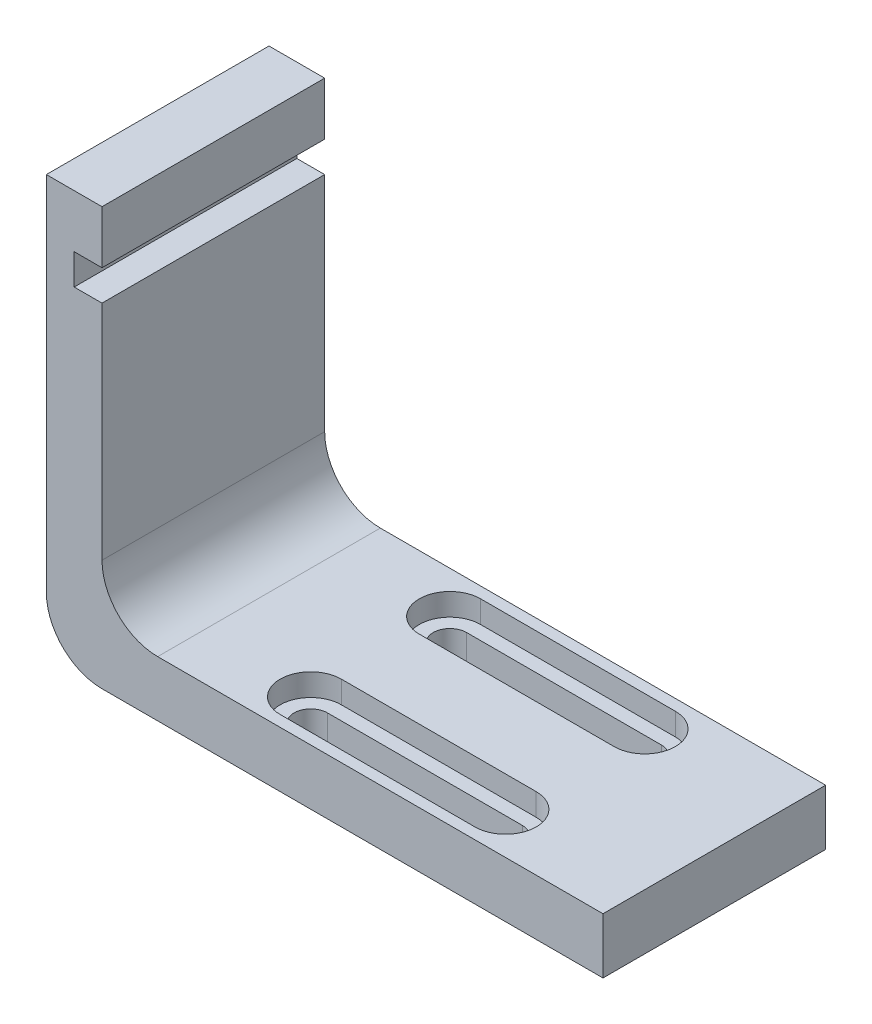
ISO-10303-21;
HEADER;
FILE_DESCRIPTION(('STEP AP214'),'2;1');
FILE_NAME('part.step','',(''),(''),'','','');
FILE_SCHEMA(('AUTOMOTIVE_DESIGN { 1 0 10303 214 1 1 1 1 }'));
ENDSEC;
DATA;
#1=APPLICATION_CONTEXT('core data for automotive mechanical design processes');
#2=APPLICATION_PROTOCOL_DEFINITION('international standard','automotive_design',2000,#1);
#3=PRODUCT_CONTEXT('',#1,'mechanical');
#4=PRODUCT('Part','Part','',(#3));
#5=PRODUCT_RELATED_PRODUCT_CATEGORY('part','',(#4));
#6=PRODUCT_DEFINITION_FORMATION('','',#4);
#7=PRODUCT_DEFINITION_CONTEXT('part definition',#1,'design');
#8=PRODUCT_DEFINITION('design','',#6,#7);
#9=PRODUCT_DEFINITION_SHAPE('','',#8);
#10=(LENGTH_UNIT() NAMED_UNIT(*) SI_UNIT(.MILLI.,.METRE.));
#11=(NAMED_UNIT(*) PLANE_ANGLE_UNIT() SI_UNIT($,.RADIAN.));
#12=(NAMED_UNIT(*) SI_UNIT($,.STERADIAN.) SOLID_ANGLE_UNIT());
#13=UNCERTAINTY_MEASURE_WITH_UNIT(LENGTH_MEASURE(1.E-05),#10,'distance_accuracy_value','');
#14=(GEOMETRIC_REPRESENTATION_CONTEXT(3) GLOBAL_UNCERTAINTY_ASSIGNED_CONTEXT((#13)) GLOBAL_UNIT_ASSIGNED_CONTEXT((#10,
#11,#12)) REPRESENTATION_CONTEXT('',''));
#15=CARTESIAN_POINT('',(0.,0.,0.));
#16=DIRECTION('',(0.,0.,1.));
#17=DIRECTION('',(1.,0.,0.));
#18=AXIS2_PLACEMENT_3D('',#15,#16,#17);
#19=CARTESIAN_POINT('',(40.,6.,-12.5));
#20=DIRECTION('',(0.,-1.,0.));
#21=DIRECTION('',(0.,0.,-1.));
#22=AXIS2_PLACEMENT_3D('',#19,#20,#21);
#23=PLANE('',#22);
#24=CARTESIAN_POINT('',(40.,6.,-12.5));
#25=DIRECTION('',(0.,-1.,0.));
#26=DIRECTION('',(0.,0.,-1.));
#27=AXIS2_PLACEMENT_3D('',#24,#25,#26);
#28=CIRCLE('',#27,5.5);
#29=CARTESIAN_POINT('',(40.,6.,-7.));
#30=VERTEX_POINT('',#29);
#31=CARTESIAN_POINT('',(40.,6.,-18.));
#32=VERTEX_POINT('',#31);
#33=EDGE_CURVE('E323',#30,#32,#28,.T.);
#34=ORIENTED_EDGE('',*,*,#33,.F.);
#35=DIRECTION('',(1.,0.,0.));
#36=VECTOR('',#35,1.);
#37=CARTESIAN_POINT('',(40.,6.,-7.));
#38=LINE('',#37,#36);
#39=CARTESIAN_POINT('',(75.,6.,-7.));
#40=VERTEX_POINT('',#39);
#41=EDGE_CURVE('E334',#30,#40,#38,.T.);
#42=ORIENTED_EDGE('',*,*,#41,.T.);
#43=CARTESIAN_POINT('',(75.,6.,-12.5));
#44=DIRECTION('',(0.,-1.,0.));
#45=DIRECTION('',(0.,0.,-1.));
#46=AXIS2_PLACEMENT_3D('',#43,#44,#45);
#47=CIRCLE('',#46,5.5);
#48=CARTESIAN_POINT('',(75.,6.,-18.));
#49=VERTEX_POINT('',#48);
#50=EDGE_CURVE('E331',#49,#40,#47,.T.);
#51=ORIENTED_EDGE('',*,*,#50,.F.);
#52=DIRECTION('',(1.,0.,0.));
#53=VECTOR('',#52,1.);
#54=CARTESIAN_POINT('',(40.,6.,-18.));
#55=LINE('',#54,#53);
#56=EDGE_CURVE('E327',#32,#49,#55,.T.);
#57=ORIENTED_EDGE('',*,*,#56,.F.);
#58=EDGE_LOOP('',(#34,#42,#51,#57));
#59=FACE_BOUND('',#58,.T.);
#60=CARTESIAN_POINT('',(75.,6.,-12.5));
#61=DIRECTION('',(0.,1.,0.));
#62=DIRECTION('',(0.,0.,-1.));
#63=AXIS2_PLACEMENT_3D('',#60,#61,#62);
#64=CIRCLE('',#63,3.);
#65=CARTESIAN_POINT('',(75.,6.,-9.5));
#66=VERTEX_POINT('',#65);
#67=CARTESIAN_POINT('',(75.,6.,-15.5));
#68=VERTEX_POINT('',#67);
#69=EDGE_CURVE('E232',#66,#68,#64,.T.);
#70=ORIENTED_EDGE('',*,*,#69,.F.);
#71=DIRECTION('',(1.,0.,0.));
#72=VECTOR('',#71,1.);
#73=CARTESIAN_POINT('',(75.,6.,-9.5));
#74=LINE('',#73,#72);
#75=CARTESIAN_POINT('',(40.,6.,-9.5));
#76=VERTEX_POINT('',#75);
#77=EDGE_CURVE('E253',#76,#66,#74,.T.);
#78=ORIENTED_EDGE('',*,*,#77,.F.);
#79=CARTESIAN_POINT('',(40.,6.,-12.5));
#80=DIRECTION('',(0.,1.,0.));
#81=DIRECTION('',(0.,0.,-1.));
#82=AXIS2_PLACEMENT_3D('',#79,#80,#81);
#83=CIRCLE('',#82,3.);
#84=CARTESIAN_POINT('',(40.,6.,-15.5));
#85=VERTEX_POINT('',#84);
#86=EDGE_CURVE('E64',#85,#76,#83,.T.);
#87=ORIENTED_EDGE('',*,*,#86,.F.);
#88=DIRECTION('',(-1.,0.,0.));
#89=VECTOR('',#88,1.);
#90=CARTESIAN_POINT('',(40.,6.,-15.5));
#91=LINE('',#90,#89);
#92=EDGE_CURVE('E267',#68,#85,#91,.T.);
#93=ORIENTED_EDGE('',*,*,#92,.F.);
#94=EDGE_LOOP('',(#70,#78,#87,#93));
#95=FACE_BOUND('',#94,.T.);
#96=ADVANCED_FACE('F39',(#59,#95),#23,.F.);
#97=CARTESIAN_POINT('',(9.99999999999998,10.,-20.));
#98=DIRECTION('',(0.,1.,0.));
#99=DIRECTION('',(0.,0.,1.));
#100=AXIS2_PLACEMENT_3D('',#97,#98,#99);
#101=PLANE('',#100);
#102=CARTESIAN_POINT('',(40.,10.,12.5));
#103=DIRECTION('',(0.,1.,0.));
#104=DIRECTION('',(0.,0.,1.));
#105=AXIS2_PLACEMENT_3D('',#102,#103,#104);
#106=CIRCLE('',#105,5.5);
#107=CARTESIAN_POINT('',(40.,10.,7.));
#108=VERTEX_POINT('',#107);
#109=CARTESIAN_POINT('',(40.,10.,18.));
#110=VERTEX_POINT('',#109);
#111=EDGE_CURVE('E344',#108,#110,#106,.T.);
#112=ORIENTED_EDGE('',*,*,#111,.F.);
#113=DIRECTION('',(1.,0.,0.));
#114=VECTOR('',#113,1.);
#115=CARTESIAN_POINT('',(40.,10.,7.));
#116=LINE('',#115,#114);
#117=CARTESIAN_POINT('',(75.,10.,7.));
#118=VERTEX_POINT('',#117);
#119=EDGE_CURVE('E382',#108,#118,#116,.T.);
#120=ORIENTED_EDGE('',*,*,#119,.T.);
#121=CARTESIAN_POINT('',(75.,10.,12.5));
#122=DIRECTION('',(0.,1.,0.));
#123=DIRECTION('',(0.,0.,1.));
#124=AXIS2_PLACEMENT_3D('',#121,#122,#123);
#125=CIRCLE('',#124,5.5);
#126=CARTESIAN_POINT('',(75.,10.,18.));
#127=VERTEX_POINT('',#126);
#128=EDGE_CURVE('E386',#127,#118,#125,.T.);
#129=ORIENTED_EDGE('',*,*,#128,.F.);
#130=DIRECTION('',(1.,0.,0.));
#131=VECTOR('',#130,1.);
#132=CARTESIAN_POINT('',(40.,10.,18.));
#133=LINE('',#132,#131);
#134=EDGE_CURVE('E391',#110,#127,#133,.T.);
#135=ORIENTED_EDGE('',*,*,#134,.F.);
#136=EDGE_LOOP('',(#112,#120,#129,#135));
#137=FACE_BOUND('',#136,.T.);
#138=DIRECTION('',(-1.,0.,0.));
#139=VECTOR('',#138,1.);
#140=CARTESIAN_POINT('',(9.99999999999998,10.,-20.));
#141=LINE('',#140,#139);
#142=CARTESIAN_POINT('',(100.,10.,-20.));
#143=VERTEX_POINT('',#142);
#144=CARTESIAN_POINT('',(20.,10.,-20.));
#145=VERTEX_POINT('',#144);
#146=EDGE_CURVE('E477',#143,#145,#141,.T.);
#147=ORIENTED_EDGE('',*,*,#146,.T.);
#148=DIRECTION('',(0.,0.,1.));
#149=VECTOR('',#148,1.);
#150=CARTESIAN_POINT('',(20.,10.,20.));
#151=LINE('',#150,#149);
#152=CARTESIAN_POINT('',(20.,10.,20.));
#153=VERTEX_POINT('',#152);
#154=EDGE_CURVE('E516',#145,#153,#151,.T.);
#155=ORIENTED_EDGE('',*,*,#154,.T.);
#156=DIRECTION('',(-1.,0.,0.));
#157=VECTOR('',#156,1.);
#158=CARTESIAN_POINT('',(9.99999999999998,10.,20.));
#159=LINE('',#158,#157);
#160=CARTESIAN_POINT('',(100.,10.,20.));
#161=VERTEX_POINT('',#160);
#162=EDGE_CURVE('E454',#161,#153,#159,.T.);
#163=ORIENTED_EDGE('',*,*,#162,.F.);
#164=DIRECTION('',(0.,0.,1.));
#165=VECTOR('',#164,1.);
#166=CARTESIAN_POINT('',(100.,10.,-20.));
#167=LINE('',#166,#165);
#168=EDGE_CURVE('E498',#143,#161,#167,.T.);
#169=ORIENTED_EDGE('',*,*,#168,.F.);
#170=EDGE_LOOP('',(#147,#155,#163,#169));
#171=FACE_BOUND('',#170,.T.);
#172=DIRECTION('',(1.,0.,0.));
#173=VECTOR('',#172,1.);
#174=CARTESIAN_POINT('',(40.,10.,-7.));
#175=LINE('',#174,#173);
#176=CARTESIAN_POINT('',(40.,10.,-7.));
#177=VERTEX_POINT('',#176);
#178=CARTESIAN_POINT('',(75.,10.,-7.));
#179=VERTEX_POINT('',#178);
#180=EDGE_CURVE('E328',#177,#179,#175,.T.);
#181=ORIENTED_EDGE('',*,*,#180,.F.);
#182=CARTESIAN_POINT('',(40.,10.,-12.5));
#183=DIRECTION('',(0.,-1.,0.));
#184=DIRECTION('',(0.,0.,-1.));
#185=AXIS2_PLACEMENT_3D('',#182,#183,#184);
#186=CIRCLE('',#185,5.5);
#187=CARTESIAN_POINT('',(40.,10.,-18.));
#188=VERTEX_POINT('',#187);
#189=EDGE_CURVE('E339',#177,#188,#186,.T.);
#190=ORIENTED_EDGE('',*,*,#189,.T.);
#191=DIRECTION('',(1.,0.,0.));
#192=VECTOR('',#191,1.);
#193=CARTESIAN_POINT('',(40.,10.,-18.));
#194=LINE('',#193,#192);
#195=CARTESIAN_POINT('',(75.,10.,-18.));
#196=VERTEX_POINT('',#195);
#197=EDGE_CURVE('E343',#188,#196,#194,.T.);
#198=ORIENTED_EDGE('',*,*,#197,.T.);
#199=CARTESIAN_POINT('',(75.,10.,-12.5));
#200=DIRECTION('',(0.,-1.,0.));
#201=DIRECTION('',(0.,0.,-1.));
#202=AXIS2_PLACEMENT_3D('',#199,#200,#201);
#203=CIRCLE('',#202,5.5);
#204=EDGE_CURVE('E348',#196,#179,#203,.T.);
#205=ORIENTED_EDGE('',*,*,#204,.T.);
#206=EDGE_LOOP('',(#181,#190,#198,#205));
#207=FACE_BOUND('',#206,.T.);
#208=ADVANCED_FACE('F544',(#137,#171,#207),#101,.T.);
#209=CARTESIAN_POINT('',(10.,75.,-20.));
#210=DIRECTION('',(1.,0.,0.));
#211=DIRECTION('',(0.,1.,0.));
#212=AXIS2_PLACEMENT_3D('',#209,#210,#211);
#213=PLANE('',#212);
#214=DIRECTION('',(0.,1.,0.));
#215=VECTOR('',#214,1.);
#216=CARTESIAN_POINT('',(10.,75.,20.));
#217=LINE('',#216,#215);
#218=CARTESIAN_POINT('',(9.99999999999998,20.,20.));
#219=VERTEX_POINT('',#218);
#220=CARTESIAN_POINT('',(9.99999999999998,60.,20.));
#221=VERTEX_POINT('',#220);
#222=EDGE_CURVE('E459',#219,#221,#217,.T.);
#223=ORIENTED_EDGE('',*,*,#222,.F.);
#224=DIRECTION('',(0.,0.,1.));
#225=VECTOR('',#224,1.);
#226=CARTESIAN_POINT('',(9.99999999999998,20.,-20.));
#227=LINE('',#226,#225);
#228=CARTESIAN_POINT('',(9.99999999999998,20.,-20.));
#229=VERTEX_POINT('',#228);
#230=EDGE_CURVE('E520',#219,#229,#227,.F.);
#231=ORIENTED_EDGE('',*,*,#230,.T.);
#232=DIRECTION('',(0.,1.,0.));
#233=VECTOR('',#232,1.);
#234=CARTESIAN_POINT('',(10.,75.,-20.));
#235=LINE('',#234,#233);
#236=CARTESIAN_POINT('',(9.99999999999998,60.,-20.));
#237=VERTEX_POINT('',#236);
#238=EDGE_CURVE('E482',#229,#237,#235,.T.);
#239=ORIENTED_EDGE('',*,*,#238,.T.);
#240=DIRECTION('',(0.,0.,1.));
#241=VECTOR('',#240,1.);
#242=CARTESIAN_POINT('',(9.99999999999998,60.,-80.));
#243=LINE('',#242,#241);
#244=EDGE_CURVE('E422',#237,#221,#243,.T.);
#245=ORIENTED_EDGE('',*,*,#244,.T.);
#246=EDGE_LOOP('',(#223,#231,#239,#245));
#247=FACE_BOUND('',#246,.T.);
#248=ADVANCED_FACE('F533',(#247),#213,.T.);
#249=CARTESIAN_POINT('',(0.,0.,-20.));
#250=DIRECTION('',(-1.,0.,0.));
#251=DIRECTION('',(0.,0.,1.));
#252=AXIS2_PLACEMENT_3D('',#249,#250,#251);
#253=PLANE('',#252);
#254=CARTESIAN_POINT('',(0.,63.,0.));
#255=DIRECTION('',(-1.,0.,0.));
#256=DIRECTION('',(0.,0.,1.));
#257=AXIS2_PLACEMENT_3D('',#254,#255,#256);
#258=CIRCLE('',#257,1.5);
#259=CARTESIAN_POINT('',(0.,63.,1.5));
#260=VERTEX_POINT('',#259);
#261=EDGE_CURVE('E259',#260,#260,#258,.T.);
#262=ORIENTED_EDGE('',*,*,#261,.F.);
#263=EDGE_LOOP('',(#262));
#264=FACE_BOUND('',#263,.T.);
#265=DIRECTION('',(0.,-1.,0.));
#266=VECTOR('',#265,1.);
#267=CARTESIAN_POINT('',(0.,0.,-20.));
#268=LINE('',#267,#266);
#269=CARTESIAN_POINT('',(0.,75.,-20.));
#270=VERTEX_POINT('',#269);
#271=CARTESIAN_POINT('',(0.,10.,-20.));
#272=VERTEX_POINT('',#271);
#273=EDGE_CURVE('E466',#270,#272,#268,.T.);
#274=ORIENTED_EDGE('',*,*,#273,.T.);
#275=DIRECTION('',(0.,0.,1.));
#276=VECTOR('',#275,1.);
#277=CARTESIAN_POINT('',(0.,10.,-20.));
#278=LINE('',#277,#276);
#279=CARTESIAN_POINT('',(0.,10.,20.));
#280=VERTEX_POINT('',#279);
#281=EDGE_CURVE('E493',#272,#280,#278,.T.);
#282=ORIENTED_EDGE('',*,*,#281,.T.);
#283=DIRECTION('',(0.,-1.,0.));
#284=VECTOR('',#283,1.);
#285=CARTESIAN_POINT('',(0.,0.,20.));
#286=LINE('',#285,#284);
#287=CARTESIAN_POINT('',(0.,75.,20.));
#288=VERTEX_POINT('',#287);
#289=EDGE_CURVE('E443',#288,#280,#286,.T.);
#290=ORIENTED_EDGE('',*,*,#289,.F.);
#291=DIRECTION('',(0.,0.,1.));
#292=VECTOR('',#291,1.);
#293=CARTESIAN_POINT('',(0.,75.,-20.));
#294=LINE('',#293,#292);
#295=EDGE_CURVE('E490',#270,#288,#294,.T.);
#296=ORIENTED_EDGE('',*,*,#295,.F.);
#297=EDGE_LOOP('',(#274,#282,#290,#296));
#298=FACE_BOUND('',#297,.T.);
#299=ADVANCED_FACE('F560',(#264,#298),#253,.T.);
#300=CARTESIAN_POINT('',(0.,75.,-20.));
#301=DIRECTION('',(0.,1.,0.));
#302=DIRECTION('',(0.,0.,1.));
#303=AXIS2_PLACEMENT_3D('',#300,#301,#302);
#304=PLANE('',#303);
#305=ORIENTED_EDGE('',*,*,#295,.T.);
#306=DIRECTION('',(-1.,0.,0.));
#307=VECTOR('',#306,1.);
#308=CARTESIAN_POINT('',(0.,75.,20.));
#309=LINE('',#308,#307);
#310=CARTESIAN_POINT('',(10.,75.,20.));
#311=VERTEX_POINT('',#310);
#312=EDGE_CURVE('E462',#311,#288,#309,.T.);
#313=ORIENTED_EDGE('',*,*,#312,.F.);
#314=DIRECTION('',(0.,0.,1.));
#315=VECTOR('',#314,1.);
#316=CARTESIAN_POINT('',(10.,75.,-20.));
#317=LINE('',#316,#315);
#318=CARTESIAN_POINT('',(10.,75.,-20.));
#319=VERTEX_POINT('',#318);
#320=EDGE_CURVE('E494',#319,#311,#317,.T.);
#321=ORIENTED_EDGE('',*,*,#320,.F.);
#322=DIRECTION('',(-1.,0.,0.));
#323=VECTOR('',#322,1.);
#324=CARTESIAN_POINT('',(0.,75.,-20.));
#325=LINE('',#324,#323);
#326=EDGE_CURVE('E485',#319,#270,#325,.T.);
#327=ORIENTED_EDGE('',*,*,#326,.T.);
#328=EDGE_LOOP('',(#305,#313,#321,#327));
#329=FACE_BOUND('',#328,.T.);
#330=ADVANCED_FACE('F566',(#329),#304,.T.);
#331=DIRECTION('',(0.,0.,1.));
#332=VECTOR('',#331,1.);
#333=CARTESIAN_POINT('',(9.99999999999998,65.5,-80.));
#334=LINE('',#333,#332);
#335=CARTESIAN_POINT('',(9.99999999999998,65.5,-20.));
#336=VERTEX_POINT('',#335);
#337=CARTESIAN_POINT('',(10.,65.5,20.));
#338=VERTEX_POINT('',#337);
#339=EDGE_CURVE('E421',#336,#338,#334,.T.);
#340=ORIENTED_EDGE('',*,*,#339,.F.);
#341=EDGE_CURVE('E481',#336,#319,#235,.T.);
#342=ORIENTED_EDGE('',*,*,#341,.T.);
#343=ORIENTED_EDGE('',*,*,#320,.T.);
#344=EDGE_CURVE('E458',#338,#311,#217,.T.);
#345=ORIENTED_EDGE('',*,*,#344,.F.);
#346=EDGE_LOOP('',(#340,#342,#343,#345));
#347=FACE_BOUND('',#346,.T.);
#348=ADVANCED_FACE('F575',(#347),#213,.T.);
#349=CARTESIAN_POINT('',(100.,10.,-20.));
#350=DIRECTION('',(1.,0.,0.));
#351=DIRECTION('',(0.,0.,-1.));
#352=AXIS2_PLACEMENT_3D('',#349,#350,#351);
#353=PLANE('',#352);
#354=ORIENTED_EDGE('',*,*,#168,.T.);
#355=DIRECTION('',(0.,1.,0.));
#356=VECTOR('',#355,1.);
#357=CARTESIAN_POINT('',(100.,10.,20.));
#358=LINE('',#357,#356);
#359=CARTESIAN_POINT('',(100.,0.,20.));
#360=VERTEX_POINT('',#359);
#361=EDGE_CURVE('E450',#360,#161,#358,.T.);
#362=ORIENTED_EDGE('',*,*,#361,.F.);
#363=DIRECTION('',(0.,0.,1.));
#364=VECTOR('',#363,1.);
#365=CARTESIAN_POINT('',(100.,0.,-20.));
#366=LINE('',#365,#364);
#367=CARTESIAN_POINT('',(100.,0.,-20.));
#368=VERTEX_POINT('',#367);
#369=EDGE_CURVE('E489',#368,#360,#366,.T.);
#370=ORIENTED_EDGE('',*,*,#369,.F.);
#371=DIRECTION('',(0.,1.,0.));
#372=VECTOR('',#371,1.);
#373=CARTESIAN_POINT('',(100.,10.,-20.));
#374=LINE('',#373,#372);
#375=EDGE_CURVE('E473',#368,#143,#374,.T.);
#376=ORIENTED_EDGE('',*,*,#375,.T.);
#377=EDGE_LOOP('',(#354,#362,#370,#376));
#378=FACE_BOUND('',#377,.T.);
#379=ADVANCED_FACE('F548',(#378),#353,.T.);
#380=CARTESIAN_POINT('',(0.,0.,-20.));
#381=DIRECTION('',(0.,-1.,0.));
#382=DIRECTION('',(0.,0.,-1.));
#383=AXIS2_PLACEMENT_3D('',#380,#381,#382);
#384=PLANE('',#383);
#385=CARTESIAN_POINT('',(75.,0.,-12.5));
#386=DIRECTION('',(0.,1.,0.));
#387=DIRECTION('',(0.,0.,-1.));
#388=AXIS2_PLACEMENT_3D('',#385,#386,#387);
#389=CIRCLE('',#388,3.);
#390=CARTESIAN_POINT('',(75.,0.,-9.5));
#391=VERTEX_POINT('',#390);
#392=CARTESIAN_POINT('',(75.,0.,-15.5));
#393=VERTEX_POINT('',#392);
#394=EDGE_CURVE('E229',#391,#393,#389,.T.);
#395=ORIENTED_EDGE('',*,*,#394,.T.);
#396=DIRECTION('',(-1.,0.,0.));
#397=VECTOR('',#396,1.);
#398=CARTESIAN_POINT('',(40.,0.,-15.5));
#399=LINE('',#398,#397);
#400=CARTESIAN_POINT('',(40.,0.,-15.5));
#401=VERTEX_POINT('',#400);
#402=EDGE_CURVE('E242',#393,#401,#399,.T.);
#403=ORIENTED_EDGE('',*,*,#402,.T.);
#404=CARTESIAN_POINT('',(40.,0.,-12.5));
#405=DIRECTION('',(0.,1.,0.));
#406=DIRECTION('',(0.,0.,-1.));
#407=AXIS2_PLACEMENT_3D('',#404,#405,#406);
#408=CIRCLE('',#407,3.);
#409=CARTESIAN_POINT('',(40.,0.,-9.5));
#410=VERTEX_POINT('',#409);
#411=EDGE_CURVE('E247',#401,#410,#408,.T.);
#412=ORIENTED_EDGE('',*,*,#411,.T.);
#413=DIRECTION('',(1.,0.,0.));
#414=VECTOR('',#413,1.);
#415=CARTESIAN_POINT('',(75.,0.,-9.5));
#416=LINE('',#415,#414);
#417=EDGE_CURVE('E238',#410,#391,#416,.T.);
#418=ORIENTED_EDGE('',*,*,#417,.T.);
#419=EDGE_LOOP('',(#395,#403,#412,#418));
#420=FACE_BOUND('',#419,.T.);
#421=CARTESIAN_POINT('',(40.,0.,12.5));
#422=DIRECTION('',(0.,1.,0.));
#423=DIRECTION('',(0.,0.,1.));
#424=AXIS2_PLACEMENT_3D('',#421,#422,#423);
#425=CIRCLE('',#424,3.);
#426=CARTESIAN_POINT('',(40.,0.,9.5));
#427=VERTEX_POINT('',#426);
#428=CARTESIAN_POINT('',(40.,0.,15.5));
#429=VERTEX_POINT('',#428);
#430=EDGE_CURVE('E282',#427,#429,#425,.T.);
#431=ORIENTED_EDGE('',*,*,#430,.T.);
#432=DIRECTION('',(1.,0.,0.));
#433=VECTOR('',#432,1.);
#434=CARTESIAN_POINT('',(40.,0.,15.5));
#435=LINE('',#434,#433);
#436=CARTESIAN_POINT('',(75.,0.,15.5));
#437=VERTEX_POINT('',#436);
#438=EDGE_CURVE('E286',#429,#437,#435,.T.);
#439=ORIENTED_EDGE('',*,*,#438,.T.);
#440=CARTESIAN_POINT('',(75.,0.,12.5));
#441=DIRECTION('',(0.,1.,0.));
#442=DIRECTION('',(0.,0.,1.));
#443=AXIS2_PLACEMENT_3D('',#440,#441,#442);
#444=CIRCLE('',#443,3.);
#445=CARTESIAN_POINT('',(75.,0.,9.5));
#446=VERTEX_POINT('',#445);
#447=EDGE_CURVE('E291',#437,#446,#444,.T.);
#448=ORIENTED_EDGE('',*,*,#447,.T.);
#449=DIRECTION('',(-1.,0.,0.));
#450=VECTOR('',#449,1.);
#451=CARTESIAN_POINT('',(75.,0.,9.5));
#452=LINE('',#451,#450);
#453=EDGE_CURVE('E295',#446,#427,#452,.T.);
#454=ORIENTED_EDGE('',*,*,#453,.T.);
#455=EDGE_LOOP('',(#431,#439,#448,#454));
#456=FACE_BOUND('',#455,.T.);
#457=DIRECTION('',(1.,0.,0.));
#458=VECTOR('',#457,1.);
#459=CARTESIAN_POINT('',(0.,0.,20.));
#460=LINE('',#459,#458);
#461=CARTESIAN_POINT('',(10.,0.,20.));
#462=VERTEX_POINT('',#461);
#463=EDGE_CURVE('E447',#462,#360,#460,.T.);
#464=ORIENTED_EDGE('',*,*,#463,.F.);
#465=DIRECTION('',(0.,0.,1.));
#466=VECTOR('',#465,1.);
#467=CARTESIAN_POINT('',(10.,0.,-20.));
#468=LINE('',#467,#466);
#469=CARTESIAN_POINT('',(10.,0.,-20.));
#470=VERTEX_POINT('',#469);
#471=EDGE_CURVE('E510',#462,#470,#468,.F.);
#472=ORIENTED_EDGE('',*,*,#471,.T.);
#473=DIRECTION('',(1.,0.,0.));
#474=VECTOR('',#473,1.);
#475=CARTESIAN_POINT('',(0.,0.,-20.));
#476=LINE('',#475,#474);
#477=EDGE_CURVE('E470',#470,#368,#476,.T.);
#478=ORIENTED_EDGE('',*,*,#477,.T.);
#479=ORIENTED_EDGE('',*,*,#369,.T.);
#480=EDGE_LOOP('',(#464,#472,#478,#479));
#481=FACE_BOUND('',#480,.T.);
#482=ADVANCED_FACE('F249',(#420,#456,#481),#384,.T.);
#483=CARTESIAN_POINT('',(0.,0.,-20.));
#484=DIRECTION('',(0.,0.,-1.));
#485=DIRECTION('',(-1.,0.,0.));
#486=AXIS2_PLACEMENT_3D('',#483,#484,#485);
#487=PLANE('',#486);
#488=ORIENTED_EDGE('',*,*,#477,.F.);
#489=CARTESIAN_POINT('',(10.,10.,-20.));
#490=DIRECTION('',(0.,0.,-1.));
#491=DIRECTION('',(-1.,0.,0.));
#492=AXIS2_PLACEMENT_3D('',#489,#490,#491);
#493=CIRCLE('',#492,10.);
#494=EDGE_CURVE('E513',#470,#272,#493,.T.);
#495=ORIENTED_EDGE('',*,*,#494,.T.);
#496=ORIENTED_EDGE('',*,*,#273,.F.);
#497=ORIENTED_EDGE('',*,*,#326,.F.);
#498=ORIENTED_EDGE('',*,*,#341,.F.);
#499=DIRECTION('',(1.,0.,0.));
#500=VECTOR('',#499,1.);
#501=CARTESIAN_POINT('',(0.,65.5,-20.));
#502=LINE('',#501,#500);
#503=CARTESIAN_POINT('',(4.99999999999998,65.5,-20.));
#504=VERTEX_POINT('',#503);
#505=EDGE_CURVE('E426',#504,#336,#502,.T.);
#506=ORIENTED_EDGE('',*,*,#505,.F.);
#507=DIRECTION('',(0.,1.,0.));
#508=VECTOR('',#507,1.);
#509=CARTESIAN_POINT('',(4.99999999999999,0.,-20.));
#510=LINE('',#509,#508);
#511=CARTESIAN_POINT('',(4.99999999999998,60.,-20.));
#512=VERTEX_POINT('',#511);
#513=EDGE_CURVE('E437',#512,#504,#510,.T.);
#514=ORIENTED_EDGE('',*,*,#513,.F.);
#515=DIRECTION('',(-1.,0.,0.));
#516=VECTOR('',#515,1.);
#517=CARTESIAN_POINT('',(0.,60.,-20.));
#518=LINE('',#517,#516);
#519=EDGE_CURVE('E440',#237,#512,#518,.T.);
#520=ORIENTED_EDGE('',*,*,#519,.F.);
#521=ORIENTED_EDGE('',*,*,#238,.F.);
#522=CARTESIAN_POINT('',(20.,20.,-20.));
#523=DIRECTION('',(0.,0.,-1.));
#524=DIRECTION('',(-1.,0.,0.));
#525=AXIS2_PLACEMENT_3D('',#522,#523,#524);
#526=CIRCLE('',#525,10.);
#527=EDGE_CURVE('E11',#229,#145,#526,.F.);
#528=ORIENTED_EDGE('',*,*,#527,.T.);
#529=ORIENTED_EDGE('',*,*,#146,.F.);
#530=ORIENTED_EDGE('',*,*,#375,.F.);
#531=EDGE_LOOP('',(#488,#495,#496,#497,#498,#506,#514,#520,#521,#528,#529,#530));
#532=FACE_BOUND('',#531,.T.);
#533=ADVANCED_FACE('F540',(#532),#487,.T.);
#534=CARTESIAN_POINT('',(0.,0.,20.));
#535=DIRECTION('',(0.,0.,-1.));
#536=DIRECTION('',(-1.,0.,0.));
#537=AXIS2_PLACEMENT_3D('',#534,#535,#536);
#538=PLANE('',#537);
#539=ORIENTED_EDGE('',*,*,#289,.T.);
#540=CARTESIAN_POINT('',(10.,10.,20.));
#541=DIRECTION('',(0.,0.,-1.));
#542=DIRECTION('',(-1.,0.,0.));
#543=AXIS2_PLACEMENT_3D('',#540,#541,#542);
#544=CIRCLE('',#543,10.);
#545=EDGE_CURVE('E507',#280,#462,#544,.F.);
#546=ORIENTED_EDGE('',*,*,#545,.T.);
#547=ORIENTED_EDGE('',*,*,#463,.T.);
#548=ORIENTED_EDGE('',*,*,#361,.T.);
#549=ORIENTED_EDGE('',*,*,#162,.T.);
#550=CARTESIAN_POINT('',(20.,20.,20.));
#551=DIRECTION('',(0.,0.,-1.));
#552=DIRECTION('',(-1.,0.,0.));
#553=AXIS2_PLACEMENT_3D('',#550,#551,#552);
#554=CIRCLE('',#553,10.);
#555=EDGE_CURVE('E49',#153,#219,#554,.T.);
#556=ORIENTED_EDGE('',*,*,#555,.T.);
#557=ORIENTED_EDGE('',*,*,#222,.T.);
#558=DIRECTION('',(1.,0.,0.));
#559=VECTOR('',#558,1.);
#560=CARTESIAN_POINT('',(4.99999999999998,60.,20.));
#561=LINE('',#560,#559);
#562=CARTESIAN_POINT('',(4.99999999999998,60.,20.));
#563=VERTEX_POINT('',#562);
#564=EDGE_CURVE('E417',#563,#221,#561,.T.);
#565=ORIENTED_EDGE('',*,*,#564,.F.);
#566=DIRECTION('',(0.,-1.,0.));
#567=VECTOR('',#566,1.);
#568=CARTESIAN_POINT('',(4.99999999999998,65.5,20.));
#569=LINE('',#568,#567);
#570=CARTESIAN_POINT('',(4.99999999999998,65.5,20.));
#571=VERTEX_POINT('',#570);
#572=EDGE_CURVE('E413',#571,#563,#569,.T.);
#573=ORIENTED_EDGE('',*,*,#572,.F.);
#574=DIRECTION('',(-1.,0.,0.));
#575=VECTOR('',#574,1.);
#576=CARTESIAN_POINT('',(9.99999999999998,65.5,20.));
#577=LINE('',#576,#575);
#578=EDGE_CURVE('E368',#338,#571,#577,.T.);
#579=ORIENTED_EDGE('',*,*,#578,.F.);
#580=ORIENTED_EDGE('',*,*,#344,.T.);
#581=ORIENTED_EDGE('',*,*,#312,.T.);
#582=EDGE_LOOP('',(#539,#546,#547,#548,#549,#556,#557,#565,#573,#579,#580,#581));
#583=FACE_BOUND('',#582,.T.);
#584=ADVANCED_FACE('F526',(#583),#538,.F.);
#585=CARTESIAN_POINT('',(4.99999999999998,60.,-80.));
#586=DIRECTION('',(0.,-1.,0.));
#587=DIRECTION('',(0.,0.,-1.));
#588=AXIS2_PLACEMENT_3D('',#585,#586,#587);
#589=PLANE('',#588);
#590=ORIENTED_EDGE('',*,*,#519,.T.);
#591=DIRECTION('',(0.,0.,1.));
#592=VECTOR('',#591,1.);
#593=CARTESIAN_POINT('',(4.99999999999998,60.,-80.));
#594=LINE('',#593,#592);
#595=EDGE_CURVE('E427',#512,#563,#594,.T.);
#596=ORIENTED_EDGE('',*,*,#595,.T.);
#597=ORIENTED_EDGE('',*,*,#564,.T.);
#598=ORIENTED_EDGE('',*,*,#244,.F.);
#599=EDGE_LOOP('',(#590,#596,#597,#598));
#600=FACE_BOUND('',#599,.T.);
#601=ADVANCED_FACE('F584',(#600),#589,.F.);
#602=CARTESIAN_POINT('',(4.99999999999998,65.5,-80.));
#603=DIRECTION('',(-1.,0.,0.));
#604=DIRECTION('',(0.,-1.,0.));
#605=AXIS2_PLACEMENT_3D('',#602,#603,#604);
#606=PLANE('',#605);
#607=CARTESIAN_POINT('',(4.99999999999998,63.,0.));
#608=DIRECTION('',(-1.,0.,0.));
#609=DIRECTION('',(0.,-1.,0.));
#610=AXIS2_PLACEMENT_3D('',#607,#608,#609);
#611=CIRCLE('',#610,1.5);
#612=CARTESIAN_POINT('',(4.99999999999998,61.5,0.));
#613=VERTEX_POINT('',#612);
#614=EDGE_CURVE('E43',#613,#613,#611,.T.);
#615=ORIENTED_EDGE('',*,*,#614,.T.);
#616=EDGE_LOOP('',(#615));
#617=FACE_BOUND('',#616,.T.);
#618=ORIENTED_EDGE('',*,*,#513,.T.);
#619=DIRECTION('',(0.,0.,1.));
#620=VECTOR('',#619,1.);
#621=CARTESIAN_POINT('',(4.99999999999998,65.5,-80.));
#622=LINE('',#621,#620);
#623=EDGE_CURVE('E430',#504,#571,#622,.T.);
#624=ORIENTED_EDGE('',*,*,#623,.T.);
#625=ORIENTED_EDGE('',*,*,#572,.T.);
#626=ORIENTED_EDGE('',*,*,#595,.F.);
#627=EDGE_LOOP('',(#618,#624,#625,#626));
#628=FACE_BOUND('',#627,.T.);
#629=ADVANCED_FACE('F582',(#617,#628),#606,.F.);
#630=CARTESIAN_POINT('',(9.99999999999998,65.5,-80.));
#631=DIRECTION('',(0.,1.,0.));
#632=DIRECTION('',(0.,0.,1.));
#633=AXIS2_PLACEMENT_3D('',#630,#631,#632);
#634=PLANE('',#633);
#635=ORIENTED_EDGE('',*,*,#505,.T.);
#636=ORIENTED_EDGE('',*,*,#339,.T.);
#637=ORIENTED_EDGE('',*,*,#578,.T.);
#638=ORIENTED_EDGE('',*,*,#623,.F.);
#639=EDGE_LOOP('',(#635,#636,#637,#638));
#640=FACE_BOUND('',#639,.T.);
#641=ADVANCED_FACE('F577',(#640),#634,.F.);
#642=CARTESIAN_POINT('',(10.,10.,-20.));
#643=DIRECTION('',(0.,0.,1.));
#644=DIRECTION('',(1.,0.,0.));
#645=AXIS2_PLACEMENT_3D('',#642,#643,#644);
#646=CYLINDRICAL_SURFACE('',#645,10.);
#647=ORIENTED_EDGE('',*,*,#494,.F.);
#648=ORIENTED_EDGE('',*,*,#471,.F.);
#649=ORIENTED_EDGE('',*,*,#545,.F.);
#650=ORIENTED_EDGE('',*,*,#281,.F.);
#651=EDGE_LOOP('',(#647,#648,#649,#650));
#652=FACE_BOUND('',#651,.T.);
#653=ADVANCED_FACE('F557',(#652),#646,.T.);
#654=CARTESIAN_POINT('',(20.,20.,-20.));
#655=DIRECTION('',(0.,0.,-1.));
#656=DIRECTION('',(-1.,0.,0.));
#657=AXIS2_PLACEMENT_3D('',#654,#655,#656);
#658=CYLINDRICAL_SURFACE('',#657,10.);
#659=ORIENTED_EDGE('',*,*,#527,.F.);
#660=ORIENTED_EDGE('',*,*,#230,.F.);
#661=ORIENTED_EDGE('',*,*,#555,.F.);
#662=ORIENTED_EDGE('',*,*,#154,.F.);
#663=EDGE_LOOP('',(#659,#660,#661,#662));
#664=FACE_BOUND('',#663,.T.);
#665=ADVANCED_FACE('F41',(#664),#658,.F.);
#666=CARTESIAN_POINT('',(40.,6.,12.5));
#667=DIRECTION('',(0.,1.,0.));
#668=DIRECTION('',(0.,0.,1.));
#669=AXIS2_PLACEMENT_3D('',#666,#667,#668);
#670=CYLINDRICAL_SURFACE('',#669,5.5);
#671=ORIENTED_EDGE('',*,*,#111,.T.);
#672=DIRECTION('',(0.,1.,0.));
#673=VECTOR('',#672,1.);
#674=CARTESIAN_POINT('',(40.,6.,18.));
#675=LINE('',#674,#673);
#676=CARTESIAN_POINT('',(40.,6.,18.));
#677=VERTEX_POINT('',#676);
#678=EDGE_CURVE('E369',#677,#110,#675,.T.);
#679=ORIENTED_EDGE('',*,*,#678,.F.);
#680=CARTESIAN_POINT('',(40.,6.,12.5));
#681=DIRECTION('',(0.,1.,0.));
#682=DIRECTION('',(0.,0.,1.));
#683=AXIS2_PLACEMENT_3D('',#680,#681,#682);
#684=CIRCLE('',#683,5.5);
#685=CARTESIAN_POINT('',(40.,6.,7.));
#686=VERTEX_POINT('',#685);
#687=EDGE_CURVE('E387',#686,#677,#684,.T.);
#688=ORIENTED_EDGE('',*,*,#687,.F.);
#689=DIRECTION('',(0.,1.,0.));
#690=VECTOR('',#689,1.);
#691=CARTESIAN_POINT('',(40.,6.,7.));
#692=LINE('',#691,#690);
#693=EDGE_CURVE('E276',#686,#108,#692,.T.);
#694=ORIENTED_EDGE('',*,*,#693,.T.);
#695=EDGE_LOOP('',(#671,#679,#688,#694));
#696=FACE_BOUND('',#695,.T.);
#697=ADVANCED_FACE('F626',(#696),#670,.F.);
#698=CARTESIAN_POINT('',(40.,6.,7.));
#699=DIRECTION('',(0.,0.,1.));
#700=DIRECTION('',(1.,0.,0.));
#701=AXIS2_PLACEMENT_3D('',#698,#699,#700);
#702=PLANE('',#701);
#703=ORIENTED_EDGE('',*,*,#119,.F.);
#704=ORIENTED_EDGE('',*,*,#693,.F.);
#705=DIRECTION('',(1.,0.,0.));
#706=VECTOR('',#705,1.);
#707=CARTESIAN_POINT('',(40.,6.,7.));
#708=LINE('',#707,#706);
#709=CARTESIAN_POINT('',(75.,6.,7.));
#710=VERTEX_POINT('',#709);
#711=EDGE_CURVE('E373',#686,#710,#708,.T.);
#712=ORIENTED_EDGE('',*,*,#711,.T.);
#713=DIRECTION('',(0.,1.,0.));
#714=VECTOR('',#713,1.);
#715=CARTESIAN_POINT('',(75.,6.,7.));
#716=LINE('',#715,#714);
#717=EDGE_CURVE('E377',#710,#118,#716,.T.);
#718=ORIENTED_EDGE('',*,*,#717,.T.);
#719=EDGE_LOOP('',(#703,#704,#712,#718));
#720=FACE_BOUND('',#719,.T.);
#721=ADVANCED_FACE('F629',(#720),#702,.T.);
#722=CARTESIAN_POINT('',(75.,6.,12.5));
#723=DIRECTION('',(0.,1.,0.));
#724=DIRECTION('',(0.,0.,1.));
#725=AXIS2_PLACEMENT_3D('',#722,#723,#724);
#726=CYLINDRICAL_SURFACE('',#725,5.5);
#727=ORIENTED_EDGE('',*,*,#128,.T.);
#728=ORIENTED_EDGE('',*,*,#717,.F.);
#729=CARTESIAN_POINT('',(75.,6.,12.5));
#730=DIRECTION('',(0.,1.,0.));
#731=DIRECTION('',(0.,0.,1.));
#732=AXIS2_PLACEMENT_3D('',#729,#730,#731);
#733=CIRCLE('',#732,5.5);
#734=CARTESIAN_POINT('',(75.,6.,18.));
#735=VERTEX_POINT('',#734);
#736=EDGE_CURVE('E399',#735,#710,#733,.T.);
#737=ORIENTED_EDGE('',*,*,#736,.F.);
#738=DIRECTION('',(0.,1.,0.));
#739=VECTOR('',#738,1.);
#740=CARTESIAN_POINT('',(75.,6.,18.));
#741=LINE('',#740,#739);
#742=EDGE_CURVE('E374',#735,#127,#741,.T.);
#743=ORIENTED_EDGE('',*,*,#742,.T.);
#744=EDGE_LOOP('',(#727,#728,#737,#743));
#745=FACE_BOUND('',#744,.T.);
#746=ADVANCED_FACE('F634',(#745),#726,.F.);
#747=CARTESIAN_POINT('',(40.,6.,18.));
#748=DIRECTION('',(0.,0.,1.));
#749=DIRECTION('',(1.,0.,0.));
#750=AXIS2_PLACEMENT_3D('',#747,#748,#749);
#751=PLANE('',#750);
#752=ORIENTED_EDGE('',*,*,#134,.T.);
#753=ORIENTED_EDGE('',*,*,#742,.F.);
#754=DIRECTION('',(1.,0.,0.));
#755=VECTOR('',#754,1.);
#756=CARTESIAN_POINT('',(40.,6.,18.));
#757=LINE('',#756,#755);
#758=EDGE_CURVE('E403',#677,#735,#757,.T.);
#759=ORIENTED_EDGE('',*,*,#758,.F.);
#760=ORIENTED_EDGE('',*,*,#678,.T.);
#761=EDGE_LOOP('',(#752,#753,#759,#760));
#762=FACE_BOUND('',#761,.T.);
#763=ADVANCED_FACE('F631',(#762),#751,.F.);
#764=CARTESIAN_POINT('',(40.,6.,12.5));
#765=DIRECTION('',(0.,1.,0.));
#766=DIRECTION('',(0.,0.,1.));
#767=AXIS2_PLACEMENT_3D('',#764,#765,#766);
#768=PLANE('',#767);
#769=CARTESIAN_POINT('',(40.,6.,12.5));
#770=DIRECTION('',(0.,1.,0.));
#771=DIRECTION('',(0.,0.,1.));
#772=AXIS2_PLACEMENT_3D('',#769,#770,#771);
#773=CIRCLE('',#772,3.);
#774=CARTESIAN_POINT('',(40.,6.,9.5));
#775=VERTEX_POINT('',#774);
#776=CARTESIAN_POINT('',(40.,6.,15.5));
#777=VERTEX_POINT('',#776);
#778=EDGE_CURVE('E300',#775,#777,#773,.T.);
#779=ORIENTED_EDGE('',*,*,#778,.F.);
#780=DIRECTION('',(-1.,0.,0.));
#781=VECTOR('',#780,1.);
#782=CARTESIAN_POINT('',(75.,6.,9.5));
#783=LINE('',#782,#781);
#784=CARTESIAN_POINT('',(75.,6.,9.5));
#785=VERTEX_POINT('',#784);
#786=EDGE_CURVE('E287',#785,#775,#783,.T.);
#787=ORIENTED_EDGE('',*,*,#786,.F.);
#788=CARTESIAN_POINT('',(75.,6.,12.5));
#789=DIRECTION('',(0.,1.,0.));
#790=DIRECTION('',(0.,0.,1.));
#791=AXIS2_PLACEMENT_3D('',#788,#789,#790);
#792=CIRCLE('',#791,3.);
#793=CARTESIAN_POINT('',(75.,6.,15.5));
#794=VERTEX_POINT('',#793);
#795=EDGE_CURVE('E56',#794,#785,#792,.T.);
#796=ORIENTED_EDGE('',*,*,#795,.F.);
#797=DIRECTION('',(1.,0.,0.));
#798=VECTOR('',#797,1.);
#799=CARTESIAN_POINT('',(40.,6.,15.5));
#800=LINE('',#799,#798);
#801=EDGE_CURVE('E304',#777,#794,#800,.T.);
#802=ORIENTED_EDGE('',*,*,#801,.F.);
#803=EDGE_LOOP('',(#779,#787,#796,#802));
#804=FACE_BOUND('',#803,.T.);
#805=ORIENTED_EDGE('',*,*,#687,.T.);
#806=ORIENTED_EDGE('',*,*,#758,.T.);
#807=ORIENTED_EDGE('',*,*,#736,.T.);
#808=ORIENTED_EDGE('',*,*,#711,.F.);
#809=EDGE_LOOP('',(#805,#806,#807,#808));
#810=FACE_BOUND('',#809,.T.);
#811=ADVANCED_FACE('F624',(#804,#810),#768,.T.);
#812=CARTESIAN_POINT('',(40.,6.,-12.5));
#813=DIRECTION('',(0.,1.,0.));
#814=DIRECTION('',(0.,0.,1.));
#815=AXIS2_PLACEMENT_3D('',#812,#813,#814);
#816=CYLINDRICAL_SURFACE('',#815,5.5);
#817=ORIENTED_EDGE('',*,*,#189,.F.);
#818=DIRECTION('',(0.,1.,0.));
#819=VECTOR('',#818,1.);
#820=CARTESIAN_POINT('',(40.,6.,-7.));
#821=LINE('',#820,#819);
#822=EDGE_CURVE('E338',#30,#177,#821,.T.);
#823=ORIENTED_EDGE('',*,*,#822,.F.);
#824=ORIENTED_EDGE('',*,*,#33,.T.);
#825=DIRECTION('',(0.,1.,0.));
#826=VECTOR('',#825,1.);
#827=CARTESIAN_POINT('',(40.,6.,-18.));
#828=LINE('',#827,#826);
#829=EDGE_CURVE('E364',#32,#188,#828,.T.);
#830=ORIENTED_EDGE('',*,*,#829,.T.);
#831=EDGE_LOOP('',(#817,#823,#824,#830));
#832=FACE_BOUND('',#831,.T.);
#833=ADVANCED_FACE('F620',(#832),#816,.F.);
#834=CARTESIAN_POINT('',(40.,6.,-18.));
#835=DIRECTION('',(0.,0.,1.));
#836=DIRECTION('',(1.,0.,0.));
#837=AXIS2_PLACEMENT_3D('',#834,#835,#836);
#838=PLANE('',#837);
#839=ORIENTED_EDGE('',*,*,#197,.F.);
#840=ORIENTED_EDGE('',*,*,#829,.F.);
#841=ORIENTED_EDGE('',*,*,#56,.T.);
#842=DIRECTION('',(0.,1.,0.));
#843=VECTOR('',#842,1.);
#844=CARTESIAN_POINT('',(75.,6.,-18.));
#845=LINE('',#844,#843);
#846=EDGE_CURVE('E361',#49,#196,#845,.T.);
#847=ORIENTED_EDGE('',*,*,#846,.T.);
#848=EDGE_LOOP('',(#839,#840,#841,#847));
#849=FACE_BOUND('',#848,.T.);
#850=ADVANCED_FACE('F616',(#849),#838,.T.);
#851=CARTESIAN_POINT('',(75.,6.,-12.5));
#852=DIRECTION('',(0.,1.,0.));
#853=DIRECTION('',(0.,0.,1.));
#854=AXIS2_PLACEMENT_3D('',#851,#852,#853);
#855=CYLINDRICAL_SURFACE('',#854,5.5);
#856=ORIENTED_EDGE('',*,*,#204,.F.);
#857=ORIENTED_EDGE('',*,*,#846,.F.);
#858=ORIENTED_EDGE('',*,*,#50,.T.);
#859=DIRECTION('',(0.,1.,0.));
#860=VECTOR('',#859,1.);
#861=CARTESIAN_POINT('',(75.,6.,-7.));
#862=LINE('',#861,#860);
#863=EDGE_CURVE('E358',#40,#179,#862,.T.);
#864=ORIENTED_EDGE('',*,*,#863,.T.);
#865=EDGE_LOOP('',(#856,#857,#858,#864));
#866=FACE_BOUND('',#865,.T.);
#867=ADVANCED_FACE('F612',(#866),#855,.F.);
#868=CARTESIAN_POINT('',(40.,6.,-7.));
#869=DIRECTION('',(0.,0.,1.));
#870=DIRECTION('',(1.,0.,0.));
#871=AXIS2_PLACEMENT_3D('',#868,#869,#870);
#872=PLANE('',#871);
#873=ORIENTED_EDGE('',*,*,#180,.T.);
#874=ORIENTED_EDGE('',*,*,#863,.F.);
#875=ORIENTED_EDGE('',*,*,#41,.F.);
#876=ORIENTED_EDGE('',*,*,#822,.T.);
#877=EDGE_LOOP('',(#873,#874,#875,#876));
#878=FACE_BOUND('',#877,.T.);
#879=ADVANCED_FACE('F609',(#878),#872,.F.);
#880=CARTESIAN_POINT('',(40.,0.,12.5));
#881=DIRECTION('',(0.,1.,0.));
#882=DIRECTION('',(0.,0.,1.));
#883=AXIS2_PLACEMENT_3D('',#880,#881,#882);
#884=CYLINDRICAL_SURFACE('',#883,3.);
#885=ORIENTED_EDGE('',*,*,#778,.T.);
#886=DIRECTION('',(0.,1.,0.));
#887=VECTOR('',#886,1.);
#888=CARTESIAN_POINT('',(40.,0.,15.5));
#889=LINE('',#888,#887);
#890=EDGE_CURVE('E299',#429,#777,#889,.T.);
#891=ORIENTED_EDGE('',*,*,#890,.F.);
#892=ORIENTED_EDGE('',*,*,#430,.F.);
#893=DIRECTION('',(0.,1.,0.));
#894=VECTOR('',#893,1.);
#895=CARTESIAN_POINT('',(40.,0.,9.5));
#896=LINE('',#895,#894);
#897=EDGE_CURVE('E268',#427,#775,#896,.T.);
#898=ORIENTED_EDGE('',*,*,#897,.T.);
#899=EDGE_LOOP('',(#885,#891,#892,#898));
#900=FACE_BOUND('',#899,.T.);
#901=ADVANCED_FACE('F607',(#900),#884,.F.);
#902=CARTESIAN_POINT('',(75.,0.,9.5));
#903=DIRECTION('',(0.,0.,-1.));
#904=DIRECTION('',(-1.,0.,0.));
#905=AXIS2_PLACEMENT_3D('',#902,#903,#904);
#906=PLANE('',#905);
#907=ORIENTED_EDGE('',*,*,#786,.T.);
#908=ORIENTED_EDGE('',*,*,#897,.F.);
#909=ORIENTED_EDGE('',*,*,#453,.F.);
#910=DIRECTION('',(0.,1.,0.));
#911=VECTOR('',#910,1.);
#912=CARTESIAN_POINT('',(75.,0.,9.5));
#913=LINE('',#912,#911);
#914=EDGE_CURVE('E315',#446,#785,#913,.T.);
#915=ORIENTED_EDGE('',*,*,#914,.T.);
#916=EDGE_LOOP('',(#907,#908,#909,#915));
#917=FACE_BOUND('',#916,.T.);
#918=ADVANCED_FACE('F663',(#917),#906,.F.);
#919=CARTESIAN_POINT('',(75.,0.,12.5));
#920=DIRECTION('',(0.,1.,0.));
#921=DIRECTION('',(0.,0.,1.));
#922=AXIS2_PLACEMENT_3D('',#919,#920,#921);
#923=CYLINDRICAL_SURFACE('',#922,3.);
#924=ORIENTED_EDGE('',*,*,#795,.T.);
#925=ORIENTED_EDGE('',*,*,#914,.F.);
#926=ORIENTED_EDGE('',*,*,#447,.F.);
#927=DIRECTION('',(0.,1.,0.));
#928=VECTOR('',#927,1.);
#929=CARTESIAN_POINT('',(75.,0.,15.5));
#930=LINE('',#929,#928);
#931=EDGE_CURVE('E318',#437,#794,#930,.T.);
#932=ORIENTED_EDGE('',*,*,#931,.T.);
#933=EDGE_LOOP('',(#924,#925,#926,#932));
#934=FACE_BOUND('',#933,.T.);
#935=ADVANCED_FACE('F664',(#934),#923,.F.);
#936=CARTESIAN_POINT('',(40.,0.,15.5));
#937=DIRECTION('',(0.,0.,1.));
#938=DIRECTION('',(1.,0.,0.));
#939=AXIS2_PLACEMENT_3D('',#936,#937,#938);
#940=PLANE('',#939);
#941=ORIENTED_EDGE('',*,*,#801,.T.);
#942=ORIENTED_EDGE('',*,*,#931,.F.);
#943=ORIENTED_EDGE('',*,*,#438,.F.);
#944=ORIENTED_EDGE('',*,*,#890,.T.);
#945=EDGE_LOOP('',(#941,#942,#943,#944));
#946=FACE_BOUND('',#945,.T.);
#947=ADVANCED_FACE('F667',(#946),#940,.F.);
#948=CARTESIAN_POINT('',(75.,0.,-12.5));
#949=DIRECTION('',(0.,1.,0.));
#950=DIRECTION('',(0.,0.,1.));
#951=AXIS2_PLACEMENT_3D('',#948,#949,#950);
#952=CYLINDRICAL_SURFACE('',#951,3.);
#953=ORIENTED_EDGE('',*,*,#69,.T.);
#954=DIRECTION('',(0.,1.,0.));
#955=VECTOR('',#954,1.);
#956=CARTESIAN_POINT('',(75.,0.,-15.5));
#957=LINE('',#956,#955);
#958=EDGE_CURVE('E225',#393,#68,#957,.T.);
#959=ORIENTED_EDGE('',*,*,#958,.F.);
#960=ORIENTED_EDGE('',*,*,#394,.F.);
#961=DIRECTION('',(0.,1.,0.));
#962=VECTOR('',#961,1.);
#963=CARTESIAN_POINT('',(75.,0.,-9.5));
#964=LINE('',#963,#962);
#965=EDGE_CURVE('E273',#391,#66,#964,.T.);
#966=ORIENTED_EDGE('',*,*,#965,.T.);
#967=EDGE_LOOP('',(#953,#959,#960,#966));
#968=FACE_BOUND('',#967,.T.);
#969=ADVANCED_FACE('F227',(#968),#952,.F.);
#970=CARTESIAN_POINT('',(75.,0.,-9.5));
#971=DIRECTION('',(0.,0.,1.));
#972=DIRECTION('',(1.,0.,0.));
#973=AXIS2_PLACEMENT_3D('',#970,#971,#972);
#974=PLANE('',#973);
#975=ORIENTED_EDGE('',*,*,#77,.T.);
#976=ORIENTED_EDGE('',*,*,#965,.F.);
#977=ORIENTED_EDGE('',*,*,#417,.F.);
#978=DIRECTION('',(0.,1.,0.));
#979=VECTOR('',#978,1.);
#980=CARTESIAN_POINT('',(40.,0.,-9.5));
#981=LINE('',#980,#979);
#982=EDGE_CURVE('E277',#410,#76,#981,.T.);
#983=ORIENTED_EDGE('',*,*,#982,.T.);
#984=EDGE_LOOP('',(#975,#976,#977,#983));
#985=FACE_BOUND('',#984,.T.);
#986=ADVANCED_FACE('F829',(#985),#974,.F.);
#987=CARTESIAN_POINT('',(40.,0.,-12.5));
#988=DIRECTION('',(0.,1.,0.));
#989=DIRECTION('',(0.,0.,1.));
#990=AXIS2_PLACEMENT_3D('',#987,#988,#989);
#991=CYLINDRICAL_SURFACE('',#990,3.);
#992=ORIENTED_EDGE('',*,*,#86,.T.);
#993=ORIENTED_EDGE('',*,*,#982,.F.);
#994=ORIENTED_EDGE('',*,*,#411,.F.);
#995=DIRECTION('',(0.,1.,0.));
#996=VECTOR('',#995,1.);
#997=CARTESIAN_POINT('',(40.,0.,-15.5));
#998=LINE('',#997,#996);
#999=EDGE_CURVE('E237',#401,#85,#998,.T.);
#1000=ORIENTED_EDGE('',*,*,#999,.T.);
#1001=EDGE_LOOP('',(#992,#993,#994,#1000));
#1002=FACE_BOUND('',#1001,.T.);
#1003=ADVANCED_FACE('F837',(#1002),#991,.F.);
#1004=CARTESIAN_POINT('',(40.,0.,-15.5));
#1005=DIRECTION('',(0.,0.,-1.));
#1006=DIRECTION('',(-1.,0.,0.));
#1007=AXIS2_PLACEMENT_3D('',#1004,#1005,#1006);
#1008=PLANE('',#1007);
#1009=ORIENTED_EDGE('',*,*,#92,.T.);
#1010=ORIENTED_EDGE('',*,*,#999,.F.);
#1011=ORIENTED_EDGE('',*,*,#402,.F.);
#1012=ORIENTED_EDGE('',*,*,#958,.T.);
#1013=EDGE_LOOP('',(#1009,#1010,#1011,#1012));
#1014=FACE_BOUND('',#1013,.T.);
#1015=ADVANCED_FACE('F243',(#1014),#1008,.F.);
#1016=CARTESIAN_POINT('',(-6.,63.,0.));
#1017=DIRECTION('',(1.,0.,0.));
#1018=DIRECTION('',(0.,1.,0.));
#1019=AXIS2_PLACEMENT_3D('',#1016,#1017,#1018);
#1020=CYLINDRICAL_SURFACE('',#1019,1.5);
#1021=ORIENTED_EDGE('',*,*,#261,.T.);
#1022=EDGE_LOOP('',(#1021));
#1023=FACE_BOUND('',#1022,.T.);
#1024=ORIENTED_EDGE('',*,*,#614,.F.);
#1025=EDGE_LOOP('',(#1024));
#1026=FACE_BOUND('',#1025,.T.);
#1027=ADVANCED_FACE('F852',(#1023,#1026),#1020,.F.);
#1028=CLOSED_SHELL('',(#96,#208,#248,#299,#330,#348,#379,#482,#533,#584,#601,#629,#641,#653,
#665,#697,#721,#746,#763,#811,#833,#850,#867,#879,#901,#918,#935,#947,#969,#986,#1003,#1015,#1027));
#1029=MANIFOLD_SOLID_BREP('B2',#1028);
#1030=ADVANCED_BREP_SHAPE_REPRESENTATION('',(#18,#1029),#14);
#1031=SHAPE_DEFINITION_REPRESENTATION(#9,#1030);
ENDSEC;
END-ISO-10303-21;
